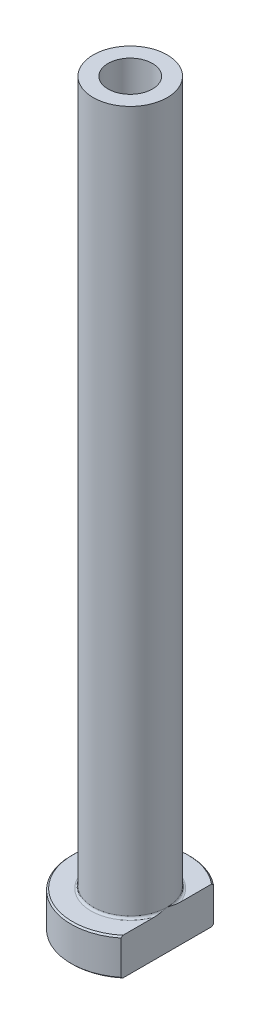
from build123d import *

# Parameters (mm, degrees)
FILLET1_R          = 0.3
CHAMFER1_SIZE      = 0.2
CUT_EXTRUDE1_DEPTH = 101.637965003
CHAMFER2_SIZE      = 0.5


with BuildPart() as part:
    # Sketch1 → Revolve1 (revolve)
    with BuildSketch(Plane.XY, mode=Mode.PRIVATE) as revolve1_sk:
        Polygon((-3, 100), (-5, 100), (-5, 5), (-8, 5), (-8, 0), (-3.25, 0), (-3.25, 43), (-3, 55), align=None)
    revolve(revolve1_sk.sketch.rotate(Axis((0, 92.187680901, 0), (0, -1, 0)), 270), axis=Axis((0, 92.187680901, 0), (0, -1, 0)))

    # Fillet1
    fillet1_edges = [part.edges().sort_by_distance(p)[0] for p in [
        (0, 5, -5),
    ]]
    fillet(fillet1_edges, radius=FILLET1_R)

    # Chamfer1
    chamfer1_edges = [part.edges().sort_by_distance(p)[0] for p in [
        (0, 0, -8),
        (0, 5, -8),
    ]]
    chamfer(chamfer1_edges, length=CHAMFER1_SIZE)

    # Sketch2 → Cut-Extrude1 (cut, through all)
    with BuildSketch(Plane.XZ):
        with BuildLine():
            Line((5, 6.244997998), (5, -6.244997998))
            ThreePointArc((5, -6.244997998), (8, 0), (5, 6.244997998))
        make_face()
    extrude(amount=-CUT_EXTRUDE1_DEPTH, mode=Mode.SUBTRACT)

    # Chamfer2
    chamfer2_edges = [part.edges().sort_by_distance(p)[0] for p in [
        (0, 0, -3.25),
    ]]
    chamfer(chamfer2_edges, length=CHAMFER2_SIZE)


solid = part.part
